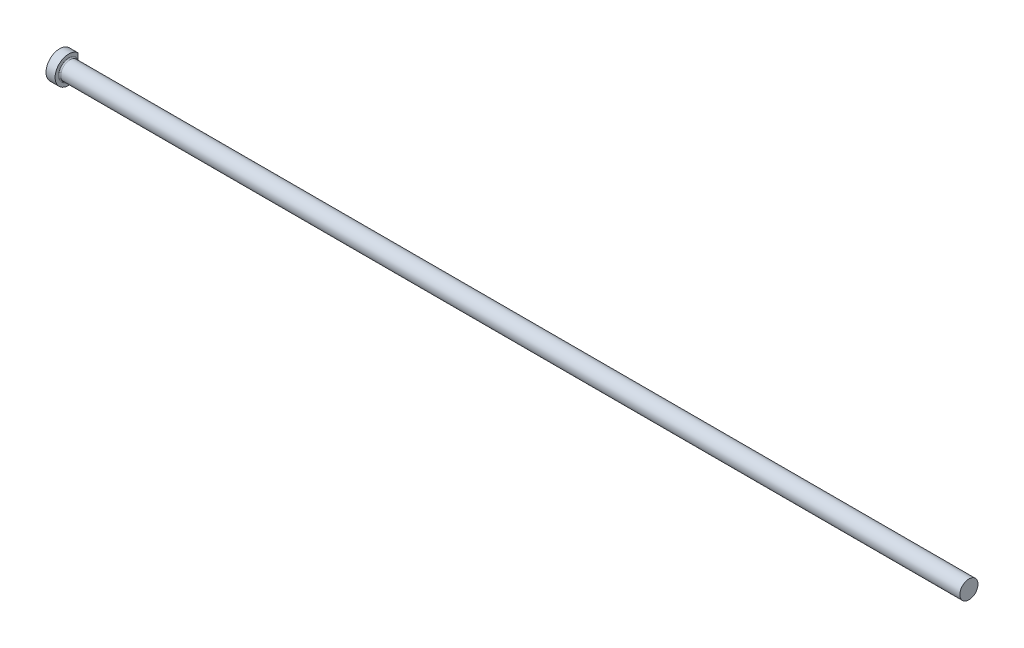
from build123d import *


with BuildPart() as part:
    # Sketch1 → PIN (revolve)
    with BuildSketch(Plane.XY, mode=Mode.PRIVATE) as pin_sk:
        with BuildLine():
            Line((0, 0), (0, 9.525))
            Line((0, 9.525), (6.35, 9.525))
            Line((6.35, 9.525), (6.35, 7.1374))
            ThreePointArc((6.35, 7.1374), (6.58062412, 6.58062412), (7.1374, 6.35))
            Line((7.1374, 6.35), (635, 6.35))
            Line((635, 6.35), (635, 0))
            Line((635, 0), (0, 0))
        make_face()
    revolve(pin_sk.sketch.rotate(Axis((635, 0, 0), (-1, 0, 0)), 180), axis=Axis((635, 0, 0), (-1, 0, 0)))

    # SurfaceCut1
    split(bisect_by=Plane(origin=(0, 0, -6.5278), x_dir=(-1, 0, 0), z_dir=(0, 0, -1)), keep=Keep.BOTTOM)


solid = part.part
